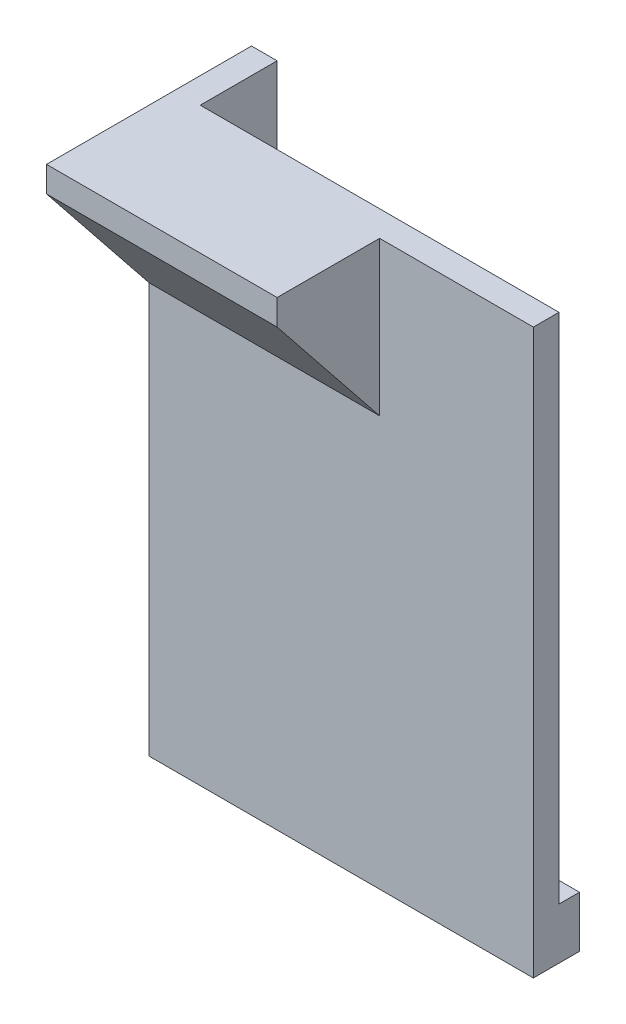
ISO-10303-21;
HEADER;
FILE_DESCRIPTION(('STEP AP214'),'2;1');
FILE_NAME('part.step','',(''),(''),'','','');
FILE_SCHEMA(('AUTOMOTIVE_DESIGN { 1 0 10303 214 1 1 1 1 }'));
ENDSEC;
DATA;
#1=APPLICATION_CONTEXT('core data for automotive mechanical design processes');
#2=APPLICATION_PROTOCOL_DEFINITION('international standard','automotive_design',2000,#1);
#3=PRODUCT_CONTEXT('',#1,'mechanical');
#4=PRODUCT('Part','Part','',(#3));
#5=PRODUCT_RELATED_PRODUCT_CATEGORY('part','',(#4));
#6=PRODUCT_DEFINITION_FORMATION('','',#4);
#7=PRODUCT_DEFINITION_CONTEXT('part definition',#1,'design');
#8=PRODUCT_DEFINITION('design','',#6,#7);
#9=PRODUCT_DEFINITION_SHAPE('','',#8);
#10=(LENGTH_UNIT() NAMED_UNIT(*) SI_UNIT(.MILLI.,.METRE.));
#11=(NAMED_UNIT(*) PLANE_ANGLE_UNIT() SI_UNIT($,.RADIAN.));
#12=(NAMED_UNIT(*) SI_UNIT($,.STERADIAN.) SOLID_ANGLE_UNIT());
#13=UNCERTAINTY_MEASURE_WITH_UNIT(LENGTH_MEASURE(1.E-05),#10,'distance_accuracy_value','');
#14=(GEOMETRIC_REPRESENTATION_CONTEXT(3) GLOBAL_UNCERTAINTY_ASSIGNED_CONTEXT((#13)) GLOBAL_UNIT_ASSIGNED_CONTEXT((#10,
#11,#12)) REPRESENTATION_CONTEXT('',''));
#15=CARTESIAN_POINT('',(0.,0.,0.));
#16=DIRECTION('',(0.,0.,1.));
#17=DIRECTION('',(1.,0.,0.));
#18=AXIS2_PLACEMENT_3D('',#15,#16,#17);
#19=CARTESIAN_POINT('',(0.,-10.,5.));
#20=DIRECTION('',(0.,0.,1.));
#21=DIRECTION('',(1.,0.,0.));
#22=AXIS2_PLACEMENT_3D('',#19,#20,#21);
#23=PLANE('',#22);
#24=DIRECTION('',(1.,0.,0.));
#25=VECTOR('',#24,1.);
#26=CARTESIAN_POINT('',(0.,100.,5.));
#27=LINE('',#26,#25);
#28=CARTESIAN_POINT('',(40.,100.,5.));
#29=VERTEX_POINT('',#28);
#30=CARTESIAN_POINT('',(70.,100.,5.));
#31=VERTEX_POINT('',#30);
#32=EDGE_CURVE('E263',#29,#31,#27,.T.);
#33=ORIENTED_EDGE('',*,*,#32,.F.);
#34=DIRECTION('',(0.,-1.,0.));
#35=VECTOR('',#34,1.);
#36=CARTESIAN_POINT('',(40.,70.,5.));
#37=LINE('',#36,#35);
#38=CARTESIAN_POINT('',(40.,70.,5.));
#39=VERTEX_POINT('',#38);
#40=EDGE_CURVE('E244',#29,#39,#37,.T.);
#41=ORIENTED_EDGE('',*,*,#40,.T.);
#42=DIRECTION('',(1.,0.,0.));
#43=VECTOR('',#42,1.);
#44=CARTESIAN_POINT('',(-5.,70.,5.));
#45=LINE('',#44,#43);
#46=CARTESIAN_POINT('',(-5.,70.,5.));
#47=VERTEX_POINT('',#46);
#48=EDGE_CURVE('E57',#47,#39,#45,.T.);
#49=ORIENTED_EDGE('',*,*,#48,.F.);
#50=DIRECTION('',(0.,1.,0.));
#51=VECTOR('',#50,1.);
#52=CARTESIAN_POINT('',(-5.,-10.,5.));
#53=LINE('',#52,#51);
#54=CARTESIAN_POINT('',(-5.,-10.,5.));
#55=VERTEX_POINT('',#54);
#56=EDGE_CURVE('E12',#55,#47,#53,.T.);
#57=ORIENTED_EDGE('',*,*,#56,.F.);
#58=DIRECTION('',(1.,0.,0.));
#59=VECTOR('',#58,1.);
#60=CARTESIAN_POINT('',(0.,-10.,5.));
#61=LINE('',#60,#59);
#62=CARTESIAN_POINT('',(70.,-10.,5.));
#63=VERTEX_POINT('',#62);
#64=EDGE_CURVE('E312',#55,#63,#61,.T.);
#65=ORIENTED_EDGE('',*,*,#64,.T.);
#66=DIRECTION('',(0.,1.,0.));
#67=VECTOR('',#66,1.);
#68=CARTESIAN_POINT('',(70.,-10.,5.));
#69=LINE('',#68,#67);
#70=EDGE_CURVE('E272',#63,#31,#69,.T.);
#71=ORIENTED_EDGE('',*,*,#70,.T.);
#72=EDGE_LOOP('',(#33,#41,#49,#57,#65,#71));
#73=FACE_BOUND('',#72,.T.);
#74=ADVANCED_FACE('F33',(#73),#23,.T.);
#75=CARTESIAN_POINT('',(-5.,-10.,-15.));
#76=DIRECTION('',(-1.,0.,0.));
#77=DIRECTION('',(0.,0.,1.));
#78=AXIS2_PLACEMENT_3D('',#75,#76,#77);
#79=PLANE('',#78);
#80=ORIENTED_EDGE('',*,*,#56,.T.);
#81=DIRECTION('',(0.,-0.78086880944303,-0.624695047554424));
#82=VECTOR('',#81,1.);
#83=CARTESIAN_POINT('',(-5.,95.,25.));
#84=LINE('',#83,#82);
#85=CARTESIAN_POINT('',(-5.,95.,25.));
#86=VERTEX_POINT('',#85);
#87=EDGE_CURVE('E260',#86,#47,#84,.T.);
#88=ORIENTED_EDGE('',*,*,#87,.F.);
#89=DIRECTION('',(0.,-1.,0.));
#90=VECTOR('',#89,1.);
#91=CARTESIAN_POINT('',(-5.,100.,25.));
#92=LINE('',#91,#90);
#93=CARTESIAN_POINT('',(-5.,100.,25.));
#94=VERTEX_POINT('',#93);
#95=EDGE_CURVE('E257',#94,#86,#92,.T.);
#96=ORIENTED_EDGE('',*,*,#95,.F.);
#97=DIRECTION('',(0.,0.,-1.));
#98=VECTOR('',#97,1.);
#99=CARTESIAN_POINT('',(-5.,100.,-15.));
#100=LINE('',#99,#98);
#101=CARTESIAN_POINT('',(-5.,100.,-15.));
#102=VERTEX_POINT('',#101);
#103=EDGE_CURVE('E314',#102,#94,#100,.F.);
#104=ORIENTED_EDGE('',*,*,#103,.F.);
#105=DIRECTION('',(0.,1.,0.));
#106=VECTOR('',#105,1.);
#107=CARTESIAN_POINT('',(-5.,-10.,-15.));
#108=LINE('',#107,#106);
#109=CARTESIAN_POINT('',(-5.,-10.,-15.));
#110=VERTEX_POINT('',#109);
#111=EDGE_CURVE('E41',#110,#102,#108,.T.);
#112=ORIENTED_EDGE('',*,*,#111,.F.);
#113=DIRECTION('',(0.,0.,-1.));
#114=VECTOR('',#113,1.);
#115=CARTESIAN_POINT('',(-5.,-10.,-15.));
#116=LINE('',#115,#114);
#117=EDGE_CURVE('E280',#110,#55,#116,.F.);
#118=ORIENTED_EDGE('',*,*,#117,.T.);
#119=EDGE_LOOP('',(#80,#88,#96,#104,#112,#118));
#120=FACE_BOUND('',#119,.T.);
#121=ADVANCED_FACE('F338',(#120),#79,.T.);
#122=CARTESIAN_POINT('',(-5.,-10.,-15.));
#123=DIRECTION('',(0.,0.,1.));
#124=DIRECTION('',(1.,0.,0.));
#125=AXIS2_PLACEMENT_3D('',#122,#123,#124);
#126=PLANE('',#125);
#127=ORIENTED_EDGE('',*,*,#111,.T.);
#128=DIRECTION('',(1.,0.,0.));
#129=VECTOR('',#128,1.);
#130=CARTESIAN_POINT('',(-5.,100.,-15.));
#131=LINE('',#130,#129);
#132=CARTESIAN_POINT('',(0.,100.,-15.));
#133=VERTEX_POINT('',#132);
#134=EDGE_CURVE('E316',#102,#133,#131,.T.);
#135=ORIENTED_EDGE('',*,*,#134,.T.);
#136=DIRECTION('',(0.,1.,0.));
#137=VECTOR('',#136,1.);
#138=CARTESIAN_POINT('',(0.,-10.,-15.));
#139=LINE('',#138,#137);
#140=CARTESIAN_POINT('',(0.,-10.,-15.));
#141=VERTEX_POINT('',#140);
#142=EDGE_CURVE('E283',#141,#133,#139,.T.);
#143=ORIENTED_EDGE('',*,*,#142,.F.);
#144=DIRECTION('',(1.,0.,0.));
#145=VECTOR('',#144,1.);
#146=CARTESIAN_POINT('',(-5.,-10.,-15.));
#147=LINE('',#146,#145);
#148=EDGE_CURVE('E294',#110,#141,#147,.T.);
#149=ORIENTED_EDGE('',*,*,#148,.F.);
#150=EDGE_LOOP('',(#127,#135,#143,#149));
#151=FACE_BOUND('',#150,.T.);
#152=ADVANCED_FACE('F343',(#151),#126,.F.);
#153=CARTESIAN_POINT('',(0.,-10.,-15.));
#154=DIRECTION('',(-1.,0.,0.));
#155=DIRECTION('',(0.,0.,1.));
#156=AXIS2_PLACEMENT_3D('',#153,#154,#155);
#157=PLANE('',#156);
#158=DIRECTION('',(0.,0.,1.));
#159=VECTOR('',#158,1.);
#160=CARTESIAN_POINT('',(0.,0.,-4.));
#161=LINE('',#160,#159);
#162=CARTESIAN_POINT('',(0.,0.,-4.));
#163=VERTEX_POINT('',#162);
#164=CARTESIAN_POINT('',(0.,0.,0.));
#165=VERTEX_POINT('',#164);
#166=EDGE_CURVE('E200',#163,#165,#161,.T.);
#167=ORIENTED_EDGE('',*,*,#166,.F.);
#168=DIRECTION('',(0.,1.,0.));
#169=VECTOR('',#168,1.);
#170=CARTESIAN_POINT('',(0.,-10.000025,-4.));
#171=LINE('',#170,#169);
#172=CARTESIAN_POINT('',(0.,-10.,-4.));
#173=VERTEX_POINT('',#172);
#174=EDGE_CURVE('E232',#173,#163,#171,.T.);
#175=ORIENTED_EDGE('',*,*,#174,.F.);
#176=DIRECTION('',(0.,0.,1.));
#177=VECTOR('',#176,1.);
#178=CARTESIAN_POINT('',(0.,-10.,-15.));
#179=LINE('',#178,#177);
#180=EDGE_CURVE('E297',#141,#173,#179,.T.);
#181=ORIENTED_EDGE('',*,*,#180,.F.);
#182=ORIENTED_EDGE('',*,*,#142,.T.);
#183=DIRECTION('',(0.,0.,1.));
#184=VECTOR('',#183,1.);
#185=CARTESIAN_POINT('',(0.,100.,-15.));
#186=LINE('',#185,#184);
#187=CARTESIAN_POINT('',(0.,100.,0.));
#188=VERTEX_POINT('',#187);
#189=EDGE_CURVE('E319',#133,#188,#186,.T.);
#190=ORIENTED_EDGE('',*,*,#189,.T.);
#191=DIRECTION('',(0.,1.,0.));
#192=VECTOR('',#191,1.);
#193=CARTESIAN_POINT('',(0.,-10.,0.));
#194=LINE('',#193,#192);
#195=EDGE_CURVE('E285',#165,#188,#194,.T.);
#196=ORIENTED_EDGE('',*,*,#195,.F.);
#197=EDGE_LOOP('',(#167,#175,#181,#182,#190,#196));
#198=FACE_BOUND('',#197,.T.);
#199=ADVANCED_FACE('F376',(#198),#157,.F.);
#200=CARTESIAN_POINT('',(0.,-10.,0.));
#201=DIRECTION('',(0.,0.,1.));
#202=DIRECTION('',(1.,0.,0.));
#203=AXIS2_PLACEMENT_3D('',#200,#201,#202);
#204=PLANE('',#203);
#205=DIRECTION('',(1.,0.,0.));
#206=VECTOR('',#205,1.);
#207=CARTESIAN_POINT('',(70.,0.,0.));
#208=LINE('',#207,#206);
#209=CARTESIAN_POINT('',(50.,0.,0.));
#210=VERTEX_POINT('',#209);
#211=CARTESIAN_POINT('',(70.,0.,0.));
#212=VERTEX_POINT('',#211);
#213=EDGE_CURVE('E186',#210,#212,#208,.T.);
#214=ORIENTED_EDGE('',*,*,#213,.F.);
#215=DIRECTION('',(0.,1.,0.));
#216=VECTOR('',#215,1.);
#217=CARTESIAN_POINT('',(50.,-10.000025,0.));
#218=LINE('',#217,#216);
#219=CARTESIAN_POINT('',(50.,-10.,0.));
#220=VERTEX_POINT('',#219);
#221=EDGE_CURVE('E204',#220,#210,#218,.T.);
#222=ORIENTED_EDGE('',*,*,#221,.F.);
#223=DIRECTION('',(1.,0.,0.));
#224=VECTOR('',#223,1.);
#225=CARTESIAN_POINT('',(0.,-10.,0.));
#226=LINE('',#225,#224);
#227=CARTESIAN_POINT('',(20.,-10.,0.));
#228=VERTEX_POINT('',#227);
#229=EDGE_CURVE('E308',#228,#220,#226,.T.);
#230=ORIENTED_EDGE('',*,*,#229,.F.);
#231=DIRECTION('',(0.,1.,0.));
#232=VECTOR('',#231,1.);
#233=CARTESIAN_POINT('',(20.,-10.000025,0.));
#234=LINE('',#233,#232);
#235=CARTESIAN_POINT('',(20.,0.,0.));
#236=VERTEX_POINT('',#235);
#237=EDGE_CURVE('E236',#228,#236,#234,.T.);
#238=ORIENTED_EDGE('',*,*,#237,.T.);
#239=DIRECTION('',(1.,0.,0.));
#240=VECTOR('',#239,1.);
#241=CARTESIAN_POINT('',(0.,0.,0.));
#242=LINE('',#241,#240);
#243=EDGE_CURVE('E220',#165,#236,#242,.T.);
#244=ORIENTED_EDGE('',*,*,#243,.F.);
#245=ORIENTED_EDGE('',*,*,#195,.T.);
#246=DIRECTION('',(1.,0.,0.));
#247=VECTOR('',#246,1.);
#248=CARTESIAN_POINT('',(0.,100.,0.));
#249=LINE('',#248,#247);
#250=CARTESIAN_POINT('',(70.,100.,0.));
#251=VERTEX_POINT('',#250);
#252=EDGE_CURVE('E321',#188,#251,#249,.T.);
#253=ORIENTED_EDGE('',*,*,#252,.T.);
#254=DIRECTION('',(0.,1.,0.));
#255=VECTOR('',#254,1.);
#256=CARTESIAN_POINT('',(70.,-10.,0.));
#257=LINE('',#256,#255);
#258=EDGE_CURVE('E286',#212,#251,#257,.T.);
#259=ORIENTED_EDGE('',*,*,#258,.F.);
#260=EDGE_LOOP('',(#214,#222,#230,#238,#244,#245,#253,#259));
#261=FACE_BOUND('',#260,.T.);
#262=ADVANCED_FACE('F357',(#261),#204,.F.);
#263=CARTESIAN_POINT('',(70.,-10.,0.));
#264=DIRECTION('',(-1.,0.,0.));
#265=DIRECTION('',(0.,0.,1.));
#266=AXIS2_PLACEMENT_3D('',#263,#264,#265);
#267=PLANE('',#266);
#268=DIRECTION('',(0.,0.,1.));
#269=VECTOR('',#268,1.);
#270=CARTESIAN_POINT('',(70.,-10.,0.));
#271=LINE('',#270,#269);
#272=CARTESIAN_POINT('',(70.,-10.,0.));
#273=VERTEX_POINT('',#272);
#274=EDGE_CURVE('E310',#273,#63,#271,.T.);
#275=ORIENTED_EDGE('',*,*,#274,.F.);
#276=DIRECTION('',(0.,1.,0.));
#277=VECTOR('',#276,1.);
#278=CARTESIAN_POINT('',(70.,-10.000025,0.));
#279=LINE('',#278,#277);
#280=CARTESIAN_POINT('',(70.,-10.000025,0.));
#281=VERTEX_POINT('',#280);
#282=EDGE_CURVE('E185',#281,#273,#279,.T.);
#283=ORIENTED_EDGE('',*,*,#282,.F.);
#284=DIRECTION('',(0.,0.,-1.));
#285=VECTOR('',#284,1.);
#286=CARTESIAN_POINT('',(70.,-10.000025,0.));
#287=LINE('',#286,#285);
#288=CARTESIAN_POINT('',(70.,-10.000025,-4.));
#289=VERTEX_POINT('',#288);
#290=EDGE_CURVE('E178',#281,#289,#287,.T.);
#291=ORIENTED_EDGE('',*,*,#290,.T.);
#292=DIRECTION('',(0.,1.,0.));
#293=VECTOR('',#292,1.);
#294=CARTESIAN_POINT('',(70.,-10.000025,-4.));
#295=LINE('',#294,#293);
#296=CARTESIAN_POINT('',(70.,0.,-4.));
#297=VERTEX_POINT('',#296);
#298=EDGE_CURVE('E161',#289,#297,#295,.T.);
#299=ORIENTED_EDGE('',*,*,#298,.T.);
#300=DIRECTION('',(0.,0.,-1.));
#301=VECTOR('',#300,1.);
#302=CARTESIAN_POINT('',(70.,0.,0.));
#303=LINE('',#302,#301);
#304=EDGE_CURVE('E194',#212,#297,#303,.T.);
#305=ORIENTED_EDGE('',*,*,#304,.F.);
#306=ORIENTED_EDGE('',*,*,#258,.T.);
#307=DIRECTION('',(0.,0.,1.));
#308=VECTOR('',#307,1.);
#309=CARTESIAN_POINT('',(70.,100.,0.));
#310=LINE('',#309,#308);
#311=EDGE_CURVE('E268',#251,#31,#310,.T.);
#312=ORIENTED_EDGE('',*,*,#311,.T.);
#313=ORIENTED_EDGE('',*,*,#70,.F.);
#314=EDGE_LOOP('',(#275,#283,#291,#299,#305,#306,#312,#313));
#315=FACE_BOUND('',#314,.T.);
#316=ADVANCED_FACE('F184',(#315),#267,.F.);
#317=CARTESIAN_POINT('',(70.,-10.,5.));
#318=DIRECTION('',(0.,-1.,0.));
#319=DIRECTION('',(0.,0.,-1.));
#320=AXIS2_PLACEMENT_3D('',#317,#318,#319);
#321=PLANE('',#320);
#322=ORIENTED_EDGE('',*,*,#64,.F.);
#323=ORIENTED_EDGE('',*,*,#117,.F.);
#324=ORIENTED_EDGE('',*,*,#148,.T.);
#325=ORIENTED_EDGE('',*,*,#180,.T.);
#326=CARTESIAN_POINT('',(0.,-10.,0.));
#327=VERTEX_POINT('',#326);
#328=EDGE_CURVE('E302',#173,#327,#179,.T.);
#329=ORIENTED_EDGE('',*,*,#328,.T.);
#330=EDGE_CURVE('E305',#327,#228,#226,.T.);
#331=ORIENTED_EDGE('',*,*,#330,.T.);
#332=ORIENTED_EDGE('',*,*,#229,.T.);
#333=EDGE_CURVE('E309',#220,#273,#226,.T.);
#334=ORIENTED_EDGE('',*,*,#333,.T.);
#335=ORIENTED_EDGE('',*,*,#274,.T.);
#336=EDGE_LOOP('',(#322,#323,#324,#325,#329,#331,#332,#334,#335));
#337=FACE_BOUND('',#336,.T.);
#338=ADVANCED_FACE('F346',(#337),#321,.T.);
#339=CARTESIAN_POINT('',(70.,100.,5.));
#340=DIRECTION('',(0.,-1.,0.));
#341=DIRECTION('',(0.,0.,-1.));
#342=AXIS2_PLACEMENT_3D('',#339,#340,#341);
#343=PLANE('',#342);
#344=ORIENTED_EDGE('',*,*,#103,.T.);
#345=DIRECTION('',(1.,0.,0.));
#346=VECTOR('',#345,1.);
#347=CARTESIAN_POINT('',(-5.,100.,25.));
#348=LINE('',#347,#346);
#349=CARTESIAN_POINT('',(40.,100.,25.));
#350=VERTEX_POINT('',#349);
#351=EDGE_CURVE('E264',#94,#350,#348,.T.);
#352=ORIENTED_EDGE('',*,*,#351,.T.);
#353=DIRECTION('',(0.,0.,-1.));
#354=VECTOR('',#353,1.);
#355=CARTESIAN_POINT('',(40.,100.,5.));
#356=LINE('',#355,#354);
#357=EDGE_CURVE('E246',#350,#29,#356,.T.);
#358=ORIENTED_EDGE('',*,*,#357,.T.);
#359=ORIENTED_EDGE('',*,*,#32,.T.);
#360=ORIENTED_EDGE('',*,*,#311,.F.);
#361=ORIENTED_EDGE('',*,*,#252,.F.);
#362=ORIENTED_EDGE('',*,*,#189,.F.);
#363=ORIENTED_EDGE('',*,*,#134,.F.);
#364=EDGE_LOOP('',(#344,#352,#358,#359,#360,#361,#362,#363));
#365=FACE_BOUND('',#364,.T.);
#366=ADVANCED_FACE('F325',(#365),#343,.F.);
#367=CARTESIAN_POINT('',(-5.,95.,25.));
#368=DIRECTION('',(0.,-0.624695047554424,0.78086880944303));
#369=DIRECTION('',(0.,-0.78086880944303,-0.624695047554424));
#370=AXIS2_PLACEMENT_3D('',#367,#368,#369);
#371=PLANE('',#370);
#372=ORIENTED_EDGE('',*,*,#48,.T.);
#373=DIRECTION('',(0.,0.78086880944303,0.624695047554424));
#374=VECTOR('',#373,1.);
#375=CARTESIAN_POINT('',(40.,95.,25.));
#376=LINE('',#375,#374);
#377=CARTESIAN_POINT('',(40.,95.,25.));
#378=VERTEX_POINT('',#377);
#379=EDGE_CURVE('E241',#39,#378,#376,.T.);
#380=ORIENTED_EDGE('',*,*,#379,.T.);
#381=DIRECTION('',(1.,0.,0.));
#382=VECTOR('',#381,1.);
#383=CARTESIAN_POINT('',(-5.,95.,25.));
#384=LINE('',#383,#382);
#385=EDGE_CURVE('E261',#86,#378,#384,.T.);
#386=ORIENTED_EDGE('',*,*,#385,.F.);
#387=ORIENTED_EDGE('',*,*,#87,.T.);
#388=EDGE_LOOP('',(#372,#380,#386,#387));
#389=FACE_BOUND('',#388,.T.);
#390=ADVANCED_FACE('F336',(#389),#371,.T.);
#391=CARTESIAN_POINT('',(-5.,100.,25.));
#392=DIRECTION('',(0.,0.,1.));
#393=DIRECTION('',(1.,0.,0.));
#394=AXIS2_PLACEMENT_3D('',#391,#392,#393);
#395=PLANE('',#394);
#396=ORIENTED_EDGE('',*,*,#385,.T.);
#397=DIRECTION('',(0.,1.,0.));
#398=VECTOR('',#397,1.);
#399=CARTESIAN_POINT('',(40.,100.,25.));
#400=LINE('',#399,#398);
#401=EDGE_CURVE('E231',#378,#350,#400,.T.);
#402=ORIENTED_EDGE('',*,*,#401,.T.);
#403=ORIENTED_EDGE('',*,*,#351,.F.);
#404=ORIENTED_EDGE('',*,*,#95,.T.);
#405=EDGE_LOOP('',(#396,#402,#403,#404));
#406=FACE_BOUND('',#405,.T.);
#407=ADVANCED_FACE('F340',(#406),#395,.T.);
#408=CARTESIAN_POINT('',(40.,-10.,-15.));
#409=DIRECTION('',(-1.,0.,0.));
#410=DIRECTION('',(0.,0.,1.));
#411=AXIS2_PLACEMENT_3D('',#408,#409,#410);
#412=PLANE('',#411);
#413=ORIENTED_EDGE('',*,*,#40,.F.);
#414=ORIENTED_EDGE('',*,*,#357,.F.);
#415=ORIENTED_EDGE('',*,*,#401,.F.);
#416=ORIENTED_EDGE('',*,*,#379,.F.);
#417=EDGE_LOOP('',(#413,#414,#415,#416));
#418=FACE_BOUND('',#417,.T.);
#419=ADVANCED_FACE('F330',(#418),#412,.F.);
#420=CARTESIAN_POINT('',(0.,-10.000025,-4.));
#421=DIRECTION('',(-1.,0.,0.));
#422=DIRECTION('',(0.,0.,1.));
#423=AXIS2_PLACEMENT_3D('',#420,#421,#422);
#424=PLANE('',#423);
#425=DIRECTION('',(0.,1.,0.));
#426=VECTOR('',#425,1.);
#427=CARTESIAN_POINT('',(0.,-10.000025,0.));
#428=LINE('',#427,#426);
#429=CARTESIAN_POINT('',(0.,-10.000025,0.));
#430=VERTEX_POINT('',#429);
#431=EDGE_CURVE('E218',#430,#327,#428,.T.);
#432=ORIENTED_EDGE('',*,*,#431,.T.);
#433=ORIENTED_EDGE('',*,*,#328,.F.);
#434=CARTESIAN_POINT('',(0.,-10.000025,-4.));
#435=VERTEX_POINT('',#434);
#436=EDGE_CURVE('E228',#435,#173,#171,.T.);
#437=ORIENTED_EDGE('',*,*,#436,.F.);
#438=DIRECTION('',(0.,0.,1.));
#439=VECTOR('',#438,1.);
#440=CARTESIAN_POINT('',(0.,-10.000025,-4.));
#441=LINE('',#440,#439);
#442=EDGE_CURVE('E206',#435,#430,#441,.T.);
#443=ORIENTED_EDGE('',*,*,#442,.T.);
#444=EDGE_LOOP('',(#432,#433,#437,#443));
#445=FACE_BOUND('',#444,.T.);
#446=ADVANCED_FACE('F401',(#445),#424,.T.);
#447=CARTESIAN_POINT('',(0.,-10.000025,-4.));
#448=DIRECTION('',(0.,0.,-1.));
#449=DIRECTION('',(-1.,0.,0.));
#450=AXIS2_PLACEMENT_3D('',#447,#448,#449);
#451=PLANE('',#450);
#452=DIRECTION('',(-1.,0.,0.));
#453=VECTOR('',#452,1.);
#454=CARTESIAN_POINT('',(0.,0.,-4.));
#455=LINE('',#454,#453);
#456=CARTESIAN_POINT('',(20.,0.,-4.));
#457=VERTEX_POINT('',#456);
#458=EDGE_CURVE('E210',#457,#163,#455,.T.);
#459=ORIENTED_EDGE('',*,*,#458,.F.);
#460=DIRECTION('',(0.,1.,0.));
#461=VECTOR('',#460,1.);
#462=CARTESIAN_POINT('',(20.,-10.000025,-4.));
#463=LINE('',#462,#461);
#464=CARTESIAN_POINT('',(20.,-10.000025,-4.));
#465=VERTEX_POINT('',#464);
#466=EDGE_CURVE('E233',#465,#457,#463,.T.);
#467=ORIENTED_EDGE('',*,*,#466,.F.);
#468=DIRECTION('',(-1.,0.,0.));
#469=VECTOR('',#468,1.);
#470=CARTESIAN_POINT('',(0.,-10.000025,-4.));
#471=LINE('',#470,#469);
#472=EDGE_CURVE('E215',#465,#435,#471,.T.);
#473=ORIENTED_EDGE('',*,*,#472,.T.);
#474=ORIENTED_EDGE('',*,*,#436,.T.);
#475=ORIENTED_EDGE('',*,*,#174,.T.);
#476=EDGE_LOOP('',(#459,#467,#473,#474,#475));
#477=FACE_BOUND('',#476,.T.);
#478=ADVANCED_FACE('F404',(#477),#451,.T.);
#479=CARTESIAN_POINT('',(20.,-10.000025,-4.));
#480=DIRECTION('',(1.,0.,0.));
#481=DIRECTION('',(0.,0.,-1.));
#482=AXIS2_PLACEMENT_3D('',#479,#480,#481);
#483=PLANE('',#482);
#484=DIRECTION('',(0.,0.,-1.));
#485=VECTOR('',#484,1.);
#486=CARTESIAN_POINT('',(20.,0.,-4.));
#487=LINE('',#486,#485);
#488=EDGE_CURVE('E223',#236,#457,#487,.T.);
#489=ORIENTED_EDGE('',*,*,#488,.F.);
#490=ORIENTED_EDGE('',*,*,#237,.F.);
#491=CARTESIAN_POINT('',(20.,-10.000025,0.));
#492=VERTEX_POINT('',#491);
#493=EDGE_CURVE('E49',#492,#228,#234,.T.);
#494=ORIENTED_EDGE('',*,*,#493,.F.);
#495=DIRECTION('',(0.,0.,-1.));
#496=VECTOR('',#495,1.);
#497=CARTESIAN_POINT('',(20.,-10.000025,-4.));
#498=LINE('',#497,#496);
#499=EDGE_CURVE('E212',#492,#465,#498,.T.);
#500=ORIENTED_EDGE('',*,*,#499,.T.);
#501=ORIENTED_EDGE('',*,*,#466,.T.);
#502=EDGE_LOOP('',(#489,#490,#494,#500,#501));
#503=FACE_BOUND('',#502,.T.);
#504=ADVANCED_FACE('F410',(#503),#483,.T.);
#505=CARTESIAN_POINT('',(0.,-10.000025,0.));
#506=DIRECTION('',(0.,0.,1.));
#507=DIRECTION('',(1.,0.,0.));
#508=AXIS2_PLACEMENT_3D('',#505,#506,#507);
#509=PLANE('',#508);
#510=ORIENTED_EDGE('',*,*,#493,.T.);
#511=ORIENTED_EDGE('',*,*,#330,.F.);
#512=ORIENTED_EDGE('',*,*,#431,.F.);
#513=DIRECTION('',(1.,0.,0.));
#514=VECTOR('',#513,1.);
#515=CARTESIAN_POINT('',(0.,-10.000025,0.));
#516=LINE('',#515,#514);
#517=EDGE_CURVE('E209',#430,#492,#516,.T.);
#518=ORIENTED_EDGE('',*,*,#517,.T.);
#519=EDGE_LOOP('',(#510,#511,#512,#518));
#520=FACE_BOUND('',#519,.T.);
#521=ADVANCED_FACE('F406',(#520),#509,.T.);
#522=CARTESIAN_POINT('',(0.,-10.000025,0.));
#523=DIRECTION('',(0.,1.,0.));
#524=DIRECTION('',(0.,0.,1.));
#525=AXIS2_PLACEMENT_3D('',#522,#523,#524);
#526=PLANE('',#525);
#527=ORIENTED_EDGE('',*,*,#442,.F.);
#528=ORIENTED_EDGE('',*,*,#472,.F.);
#529=ORIENTED_EDGE('',*,*,#499,.F.);
#530=ORIENTED_EDGE('',*,*,#517,.F.);
#531=EDGE_LOOP('',(#527,#528,#529,#530));
#532=FACE_BOUND('',#531,.T.);
#533=ADVANCED_FACE('F409',(#532),#526,.F.);
#534=CARTESIAN_POINT('',(0.,0.,0.));
#535=DIRECTION('',(0.,1.,0.));
#536=DIRECTION('',(0.,0.,1.));
#537=AXIS2_PLACEMENT_3D('',#534,#535,#536);
#538=PLANE('',#537);
#539=ORIENTED_EDGE('',*,*,#166,.T.);
#540=ORIENTED_EDGE('',*,*,#243,.T.);
#541=ORIENTED_EDGE('',*,*,#488,.T.);
#542=ORIENTED_EDGE('',*,*,#458,.T.);
#543=EDGE_LOOP('',(#539,#540,#541,#542));
#544=FACE_BOUND('',#543,.T.);
#545=ADVANCED_FACE('F417',(#544),#538,.T.);
#546=CARTESIAN_POINT('',(70.,-10.000025,0.));
#547=DIRECTION('',(0.,0.,1.));
#548=DIRECTION('',(1.,0.,0.));
#549=AXIS2_PLACEMENT_3D('',#546,#547,#548);
#550=PLANE('',#549);
#551=ORIENTED_EDGE('',*,*,#282,.T.);
#552=ORIENTED_EDGE('',*,*,#333,.F.);
#553=CARTESIAN_POINT('',(50.,-10.000025,0.));
#554=VERTEX_POINT('',#553);
#555=EDGE_CURVE('E201',#554,#220,#218,.T.);
#556=ORIENTED_EDGE('',*,*,#555,.F.);
#557=DIRECTION('',(1.,0.,0.));
#558=VECTOR('',#557,1.);
#559=CARTESIAN_POINT('',(70.,-10.000025,0.));
#560=LINE('',#559,#558);
#561=EDGE_CURVE('E171',#554,#281,#560,.T.);
#562=ORIENTED_EDGE('',*,*,#561,.T.);
#563=EDGE_LOOP('',(#551,#552,#556,#562));
#564=FACE_BOUND('',#563,.T.);
#565=ADVANCED_FACE('F351',(#564),#550,.T.);
#566=CARTESIAN_POINT('',(50.,-10.000025,0.));
#567=DIRECTION('',(-1.,0.,0.));
#568=DIRECTION('',(0.,0.,1.));
#569=AXIS2_PLACEMENT_3D('',#566,#567,#568);
#570=PLANE('',#569);
#571=DIRECTION('',(0.,0.,1.));
#572=VECTOR('',#571,1.);
#573=CARTESIAN_POINT('',(50.,0.,0.));
#574=LINE('',#573,#572);
#575=CARTESIAN_POINT('',(50.,0.,-4.));
#576=VERTEX_POINT('',#575);
#577=EDGE_CURVE('E189',#576,#210,#574,.T.);
#578=ORIENTED_EDGE('',*,*,#577,.F.);
#579=DIRECTION('',(0.,1.,0.));
#580=VECTOR('',#579,1.);
#581=CARTESIAN_POINT('',(50.,-10.000025,-4.));
#582=LINE('',#581,#580);
#583=CARTESIAN_POINT('',(50.,-10.000025,-4.));
#584=VERTEX_POINT('',#583);
#585=EDGE_CURVE('E170',#584,#576,#582,.T.);
#586=ORIENTED_EDGE('',*,*,#585,.F.);
#587=DIRECTION('',(0.,0.,1.));
#588=VECTOR('',#587,1.);
#589=CARTESIAN_POINT('',(50.,-10.000025,0.));
#590=LINE('',#589,#588);
#591=EDGE_CURVE('E181',#584,#554,#590,.T.);
#592=ORIENTED_EDGE('',*,*,#591,.T.);
#593=ORIENTED_EDGE('',*,*,#555,.T.);
#594=ORIENTED_EDGE('',*,*,#221,.T.);
#595=EDGE_LOOP('',(#578,#586,#592,#593,#594));
#596=FACE_BOUND('',#595,.T.);
#597=ADVANCED_FACE('F355',(#596),#570,.T.);
#598=CARTESIAN_POINT('',(70.,-10.000025,-4.));
#599=DIRECTION('',(0.,0.,-1.));
#600=DIRECTION('',(-1.,0.,0.));
#601=AXIS2_PLACEMENT_3D('',#598,#599,#600);
#602=PLANE('',#601);
#603=DIRECTION('',(-1.,0.,0.));
#604=VECTOR('',#603,1.);
#605=CARTESIAN_POINT('',(70.,0.,-4.));
#606=LINE('',#605,#604);
#607=EDGE_CURVE('E166',#297,#576,#606,.T.);
#608=ORIENTED_EDGE('',*,*,#607,.F.);
#609=ORIENTED_EDGE('',*,*,#298,.F.);
#610=DIRECTION('',(-1.,0.,0.));
#611=VECTOR('',#610,1.);
#612=CARTESIAN_POINT('',(70.,-10.000025,-4.));
#613=LINE('',#612,#611);
#614=EDGE_CURVE('E164',#289,#584,#613,.T.);
#615=ORIENTED_EDGE('',*,*,#614,.T.);
#616=ORIENTED_EDGE('',*,*,#585,.T.);
#617=EDGE_LOOP('',(#608,#609,#615,#616));
#618=FACE_BOUND('',#617,.T.);
#619=ADVANCED_FACE('F163',(#618),#602,.T.);
#620=CARTESIAN_POINT('',(70.,-10.000025,-4.));
#621=DIRECTION('',(0.,1.,0.));
#622=DIRECTION('',(0.,0.,1.));
#623=AXIS2_PLACEMENT_3D('',#620,#621,#622);
#624=PLANE('',#623);
#625=ORIENTED_EDGE('',*,*,#290,.F.);
#626=ORIENTED_EDGE('',*,*,#561,.F.);
#627=ORIENTED_EDGE('',*,*,#591,.F.);
#628=ORIENTED_EDGE('',*,*,#614,.F.);
#629=EDGE_LOOP('',(#625,#626,#627,#628));
#630=FACE_BOUND('',#629,.T.);
#631=ADVANCED_FACE('F176',(#630),#624,.F.);
#632=CARTESIAN_POINT('',(70.,0.,-4.));
#633=DIRECTION('',(0.,1.,0.));
#634=DIRECTION('',(0.,0.,1.));
#635=AXIS2_PLACEMENT_3D('',#632,#633,#634);
#636=PLANE('',#635);
#637=ORIENTED_EDGE('',*,*,#304,.T.);
#638=ORIENTED_EDGE('',*,*,#607,.T.);
#639=ORIENTED_EDGE('',*,*,#577,.T.);
#640=ORIENTED_EDGE('',*,*,#213,.T.);
#641=EDGE_LOOP('',(#637,#638,#639,#640));
#642=FACE_BOUND('',#641,.T.);
#643=ADVANCED_FACE('F360',(#642),#636,.T.);
#644=CLOSED_SHELL('',(#74,#121,#152,#199,#262,#316,#338,#366,#390,#407,#419,#446,#478,#504,#521,
#533,#545,#565,#597,#619,#631,#643));
#645=MANIFOLD_SOLID_BREP('B2',#644);
#646=ADVANCED_BREP_SHAPE_REPRESENTATION('',(#18,#645),#14);
#647=SHAPE_DEFINITION_REPRESENTATION(#9,#646);
ENDSEC;
END-ISO-10303-21;
